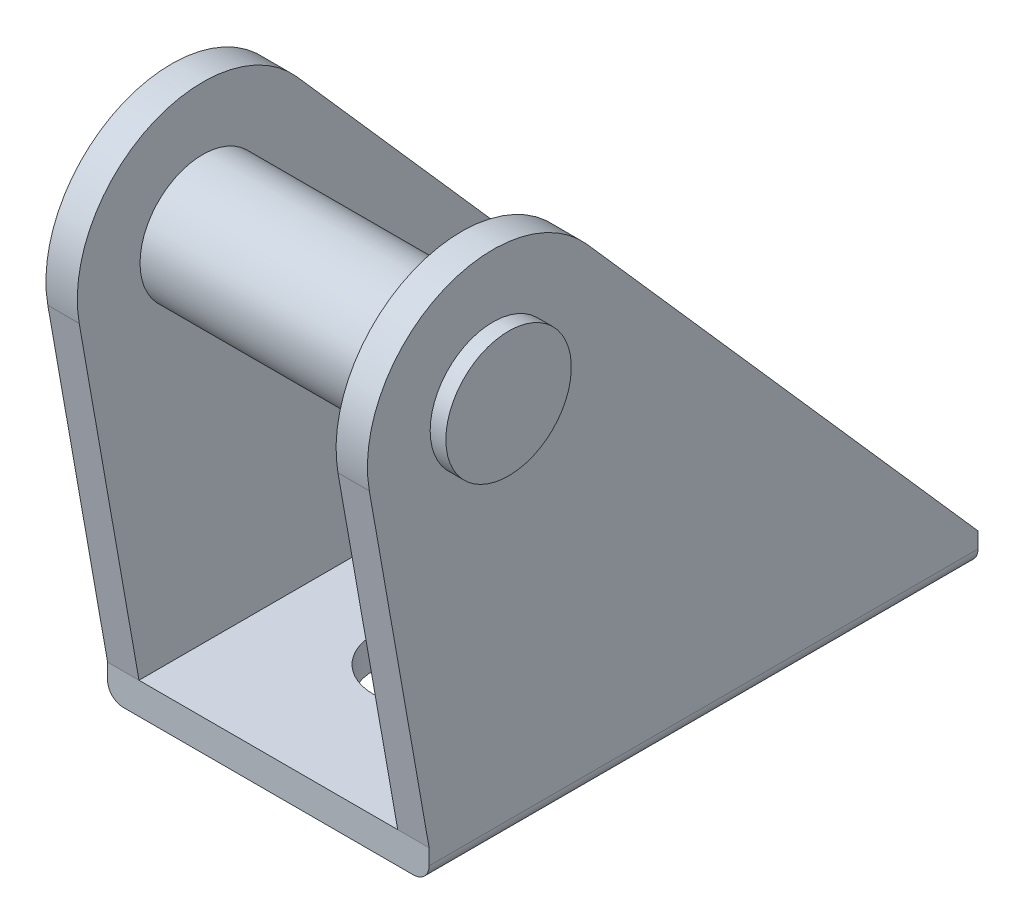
ISO-10303-21;
HEADER;
FILE_DESCRIPTION(('STEP AP214'),'2;1');
FILE_NAME('part.step','',(''),(''),'','','');
FILE_SCHEMA(('AUTOMOTIVE_DESIGN { 1 0 10303 214 1 1 1 1 }'));
ENDSEC;
DATA;
#1=APPLICATION_CONTEXT('core data for automotive mechanical design processes');
#2=APPLICATION_PROTOCOL_DEFINITION('international standard','automotive_design',2000,#1);
#3=PRODUCT_CONTEXT('',#1,'mechanical');
#4=PRODUCT('Part','Part','',(#3));
#5=PRODUCT_RELATED_PRODUCT_CATEGORY('part','',(#4));
#6=PRODUCT_DEFINITION_FORMATION('','',#4);
#7=PRODUCT_DEFINITION_CONTEXT('part definition',#1,'design');
#8=PRODUCT_DEFINITION('design','',#6,#7);
#9=PRODUCT_DEFINITION_SHAPE('','',#8);
#10=(LENGTH_UNIT() NAMED_UNIT(*) SI_UNIT(.MILLI.,.METRE.));
#11=(NAMED_UNIT(*) PLANE_ANGLE_UNIT() SI_UNIT($,.RADIAN.));
#12=(NAMED_UNIT(*) SI_UNIT($,.STERADIAN.) SOLID_ANGLE_UNIT());
#13=UNCERTAINTY_MEASURE_WITH_UNIT(LENGTH_MEASURE(1.E-05),#10,'distance_accuracy_value','');
#14=(GEOMETRIC_REPRESENTATION_CONTEXT(3) GLOBAL_UNCERTAINTY_ASSIGNED_CONTEXT((#13)) GLOBAL_UNIT_ASSIGNED_CONTEXT((#10,
#11,#12)) REPRESENTATION_CONTEXT('',''));
#15=CARTESIAN_POINT('',(0.,0.,0.));
#16=DIRECTION('',(0.,0.,1.));
#17=DIRECTION('',(1.,0.,0.));
#18=AXIS2_PLACEMENT_3D('',#15,#16,#17);
#19=CARTESIAN_POINT('',(11.25,4.048,-4.048));
#20=DIRECTION('',(-1.,0.,0.));
#21=DIRECTION('',(0.,-1.,0.));
#22=AXIS2_PLACEMENT_3D('',#19,#20,#21);
#23=PLANE('',#22);
#24=CARTESIAN_POINT('',(11.25,0.,0.));
#25=DIRECTION('',(-1.,0.,0.));
#26=DIRECTION('',(0.,0.,1.));
#27=AXIS2_PLACEMENT_3D('',#24,#25,#26);
#28=CIRCLE('',#27,4.);
#29=CARTESIAN_POINT('',(11.25,0.,4.));
#30=VERTEX_POINT('',#29);
#31=EDGE_CURVE('E19',#30,#30,#28,.F.);
#32=ORIENTED_EDGE('',*,*,#31,.T.);
#33=EDGE_LOOP('',(#32));
#34=FACE_BOUND('',#33,.T.);
#35=ADVANCED_FACE('F15',(#34),#23,.F.);
#36=CARTESIAN_POINT('',(-11.25,-4.048,4.048));
#37=DIRECTION('',(1.,0.,0.));
#38=DIRECTION('',(0.,0.,-1.));
#39=AXIS2_PLACEMENT_3D('',#36,#37,#38);
#40=PLANE('',#39);
#41=CARTESIAN_POINT('',(-11.25,0.,0.));
#42=DIRECTION('',(-1.,0.,0.));
#43=DIRECTION('',(0.,0.,1.));
#44=AXIS2_PLACEMENT_3D('',#41,#42,#43);
#45=CIRCLE('',#44,4.);
#46=CARTESIAN_POINT('',(-11.25,0.,4.));
#47=VERTEX_POINT('',#46);
#48=EDGE_CURVE('E172',#47,#47,#45,.T.);
#49=ORIENTED_EDGE('',*,*,#48,.T.);
#50=EDGE_LOOP('',(#49));
#51=FACE_BOUND('',#50,.T.);
#52=ADVANCED_FACE('F235',(#51),#40,.F.);
#53=CARTESIAN_POINT('',(11.25,0.,0.));
#54=DIRECTION('',(-1.,0.,0.));
#55=DIRECTION('',(0.,0.,1.));
#56=AXIS2_PLACEMENT_3D('',#53,#54,#55);
#57=CYLINDRICAL_SURFACE('',#56,4.);
#58=ORIENTED_EDGE('',*,*,#31,.F.);
#59=EDGE_LOOP('',(#58));
#60=FACE_BOUND('',#59,.T.);
#61=CARTESIAN_POINT('',(10.25,0.,0.));
#62=DIRECTION('',(-1.,0.,0.));
#63=DIRECTION('',(0.,0.,1.));
#64=AXIS2_PLACEMENT_3D('',#61,#62,#63);
#65=CIRCLE('',#64,4.);
#66=CARTESIAN_POINT('',(10.25,0.,4.));
#67=VERTEX_POINT('',#66);
#68=EDGE_CURVE('E162',#67,#67,#65,.F.);
#69=ORIENTED_EDGE('',*,*,#68,.T.);
#70=EDGE_LOOP('',(#69));
#71=FACE_BOUND('',#70,.T.);
#72=ADVANCED_FACE('F231',(#60,#71),#57,.T.);
#73=CARTESIAN_POINT('',(-10.25,0.,0.));
#74=DIRECTION('',(-1.,0.,0.));
#75=DIRECTION('',(0.,0.,1.));
#76=AXIS2_PLACEMENT_3D('',#73,#74,#75);
#77=CYLINDRICAL_SURFACE('',#76,4.);
#78=ORIENTED_EDGE('',*,*,#48,.F.);
#79=EDGE_LOOP('',(#78));
#80=FACE_BOUND('',#79,.T.);
#81=CARTESIAN_POINT('',(-10.25,0.,0.));
#82=DIRECTION('',(-1.,0.,0.));
#83=DIRECTION('',(0.,0.,1.));
#84=AXIS2_PLACEMENT_3D('',#81,#82,#83);
#85=CIRCLE('',#84,4.);
#86=CARTESIAN_POINT('',(-10.25,0.,4.));
#87=VERTEX_POINT('',#86);
#88=EDGE_CURVE('E148',#87,#87,#85,.T.);
#89=ORIENTED_EDGE('',*,*,#88,.T.);
#90=EDGE_LOOP('',(#89));
#91=FACE_BOUND('',#90,.T.);
#92=ADVANCED_FACE('F234',(#80,#91),#77,.T.);
#93=CARTESIAN_POINT('',(10.25,8.192,-30.932107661));
#94=DIRECTION('',(-1.,0.,0.));
#95=DIRECTION('',(0.,-1.,0.));
#96=AXIS2_PLACEMENT_3D('',#93,#94,#95);
#97=PLANE('',#96);
#98=ORIENTED_EDGE('',*,*,#68,.F.);
#99=EDGE_LOOP('',(#98));
#100=FACE_BOUND('',#99,.T.);
#101=DIRECTION('',(0.,0.,1.));
#102=VECTOR('',#101,1.);
#103=CARTESIAN_POINT('',(10.25,-24.0000000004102,-13.432107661));
#104=LINE('',#103,#102);
#105=CARTESIAN_POINT('',(10.25,-24.0000000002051,4.0678923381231));
#106=VERTEX_POINT('',#105);
#107=CARTESIAN_POINT('',(10.25,-24.0000000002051,-30.932107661));
#108=VERTEX_POINT('',#107);
#109=EDGE_CURVE('E127',#106,#108,#104,.F.);
#110=ORIENTED_EDGE('',*,*,#109,.T.);
#111=DIRECTION('',(0.,-1.,0.));
#112=VECTOR('',#111,1.);
#113=CARTESIAN_POINT('',(10.25,-7.904,-30.932107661));
#114=LINE('',#113,#112);
#115=CARTESIAN_POINT('',(10.25,-23.0000000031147,-30.932107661));
#116=VERTEX_POINT('',#115);
#117=EDGE_CURVE('E168',#116,#108,#114,.T.);
#118=ORIENTED_EDGE('',*,*,#117,.F.);
#119=DIRECTION('',(0.,0.750245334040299,0.661159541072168));
#120=VECTOR('',#119,1.);
#121=CARTESIAN_POINT('',(10.25,-8.8553618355,-18.4670351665));
#122=LINE('',#121,#120);
#123=CARTESIAN_POINT('',(10.25,5.289276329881,-6.00196267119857));
#124=VERTEX_POINT('',#123);
#125=EDGE_CURVE('E152',#116,#124,#122,.T.);
#126=ORIENTED_EDGE('',*,*,#125,.T.);
#127=CARTESIAN_POINT('',(10.25,0.,0.));
#128=DIRECTION('',(1.,0.,0.));
#129=DIRECTION('',(0.,0.,-1.));
#130=AXIS2_PLACEMENT_3D('',#127,#128,#129);
#131=CIRCLE('',#130,8.);
#132=CARTESIAN_POINT('',(10.25,-1.3891854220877,7.87846202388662));
#133=VERTEX_POINT('',#132);
#134=EDGE_CURVE('E216',#124,#133,#131,.T.);
#135=ORIENTED_EDGE('',*,*,#134,.T.);
#136=DIRECTION('',(0.,0.984807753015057,0.173648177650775));
#137=VECTOR('',#136,1.);
#138=CARTESIAN_POINT('',(10.25,-12.1945927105,5.9731771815));
#139=LINE('',#138,#137);
#140=CARTESIAN_POINT('',(10.25,-23.0000000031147,4.0678923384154));
#141=VERTEX_POINT('',#140);
#142=EDGE_CURVE('E118',#141,#133,#139,.T.);
#143=ORIENTED_EDGE('',*,*,#142,.F.);
#144=DIRECTION('',(0.,1.,0.));
#145=VECTOR('',#144,1.);
#146=CARTESIAN_POINT('',(10.25,-7.904,4.0678923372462));
#147=LINE('',#146,#145);
#148=EDGE_CURVE('E165',#106,#141,#147,.T.);
#149=ORIENTED_EDGE('',*,*,#148,.F.);
#150=EDGE_LOOP('',(#110,#118,#126,#135,#143,#149));
#151=FACE_BOUND('',#150,.T.);
#152=ADVANCED_FACE('F239',(#100,#151),#97,.F.);
#153=CARTESIAN_POINT('',(-10.25,-24.,8.233592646));
#154=DIRECTION('',(1.,0.,0.));
#155=DIRECTION('',(0.,0.,-1.));
#156=AXIS2_PLACEMENT_3D('',#153,#154,#155);
#157=PLANE('',#156);
#158=ORIENTED_EDGE('',*,*,#88,.F.);
#159=EDGE_LOOP('',(#158));
#160=FACE_BOUND('',#159,.T.);
#161=DIRECTION('',(0.,0.,-1.));
#162=VECTOR('',#161,1.);
#163=CARTESIAN_POINT('',(-10.25,-24.0000000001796,-13.432107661));
#164=LINE('',#163,#162);
#165=CARTESIAN_POINT('',(-10.25,-24.0000000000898,-30.932107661));
#166=VERTEX_POINT('',#165);
#167=CARTESIAN_POINT('',(-10.25,-24.0000000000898,4.0678923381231));
#168=VERTEX_POINT('',#167);
#169=EDGE_CURVE('E215',#166,#168,#164,.F.);
#170=ORIENTED_EDGE('',*,*,#169,.T.);
#171=DIRECTION('',(0.,-1.,0.));
#172=VECTOR('',#171,1.);
#173=CARTESIAN_POINT('',(-10.25,-7.904,4.06789233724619));
#174=LINE('',#173,#172);
#175=CARTESIAN_POINT('',(-10.25,-23.0000000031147,4.0678923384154));
#176=VERTEX_POINT('',#175);
#177=EDGE_CURVE('E158',#176,#168,#174,.T.);
#178=ORIENTED_EDGE('',*,*,#177,.F.);
#179=DIRECTION('',(0.,-0.984807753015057,-0.173648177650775));
#180=VECTOR('',#179,1.);
#181=CARTESIAN_POINT('',(-10.25,-12.1945927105,5.9731771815));
#182=LINE('',#181,#180);
#183=CARTESIAN_POINT('',(-10.25,-1.3891854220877,7.87846202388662));
#184=VERTEX_POINT('',#183);
#185=EDGE_CURVE('E98',#184,#176,#182,.T.);
#186=ORIENTED_EDGE('',*,*,#185,.F.);
#187=CARTESIAN_POINT('',(-10.25,0.,0.));
#188=DIRECTION('',(1.,0.,0.));
#189=DIRECTION('',(0.,0.,-1.));
#190=AXIS2_PLACEMENT_3D('',#187,#188,#189);
#191=CIRCLE('',#190,8.);
#192=CARTESIAN_POINT('',(-10.25,5.28927632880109,-6.00196267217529));
#193=VERTEX_POINT('',#192);
#194=EDGE_CURVE('E101',#184,#193,#191,.F.);
#195=ORIENTED_EDGE('',*,*,#194,.T.);
#196=DIRECTION('',(0.,-0.750245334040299,-0.661159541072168));
#197=VECTOR('',#196,1.);
#198=CARTESIAN_POINT('',(-10.25,-8.8553618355,-18.4670351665));
#199=LINE('',#198,#197);
#200=CARTESIAN_POINT('',(-10.25,-23.0000000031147,-30.932107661));
#201=VERTEX_POINT('',#200);
#202=EDGE_CURVE('E105',#193,#201,#199,.T.);
#203=ORIENTED_EDGE('',*,*,#202,.T.);
#204=DIRECTION('',(0.,1.,0.));
#205=VECTOR('',#204,1.);
#206=CARTESIAN_POINT('',(-10.25,-7.904,-30.932107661));
#207=LINE('',#206,#205);
#208=EDGE_CURVE('E155',#166,#201,#207,.T.);
#209=ORIENTED_EDGE('',*,*,#208,.F.);
#210=EDGE_LOOP('',(#170,#178,#186,#195,#203,#209));
#211=FACE_BOUND('',#210,.T.);
#212=ADVANCED_FACE('F104',(#160,#211),#157,.F.);
#213=CARTESIAN_POINT('',(-10.25,-1.389185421,7.878462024));
#214=DIRECTION('',(0.,-0.173648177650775,0.984807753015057));
#215=DIRECTION('',(0.,-0.984807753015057,-0.173648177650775));
#216=AXIS2_PLACEMENT_3D('',#213,#214,#215);
#217=PLANE('',#216);
#218=ORIENTED_EDGE('',*,*,#185,.T.);
#219=DIRECTION('',(-1.,0.,0.));
#220=VECTOR('',#219,1.);
#221=CARTESIAN_POINT('',(0.,-23.,4.067892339));
#222=LINE('',#221,#220);
#223=CARTESIAN_POINT('',(-8.24999999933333,-23.,4.067892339));
#224=VERTEX_POINT('',#223);
#225=EDGE_CURVE('E140',#224,#176,#222,.T.);
#226=ORIENTED_EDGE('',*,*,#225,.F.);
#227=DIRECTION('',(0.,-0.984807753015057,-0.173648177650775));
#228=VECTOR('',#227,1.);
#229=CARTESIAN_POINT('',(-8.25,-1.389185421,7.878462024));
#230=LINE('',#229,#228);
#231=CARTESIAN_POINT('',(-8.25,-1.3891854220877,7.87846202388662));
#232=VERTEX_POINT('',#231);
#233=EDGE_CURVE('E143',#224,#232,#230,.F.);
#234=ORIENTED_EDGE('',*,*,#233,.T.);
#235=DIRECTION('',(1.,0.,0.));
#236=VECTOR('',#235,1.);
#237=CARTESIAN_POINT('',(-9.25,-1.38918542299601,7.87846202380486));
#238=LINE('',#237,#236);
#239=EDGE_CURVE('E111',#232,#184,#238,.F.);
#240=ORIENTED_EDGE('',*,*,#239,.T.);
#241=EDGE_LOOP('',(#218,#226,#234,#240));
#242=FACE_BOUND('',#241,.T.);
#243=ADVANCED_FACE('F311',(#242),#217,.T.);
#244=CARTESIAN_POINT('',(-10.25,0.,0.));
#245=DIRECTION('',(1.,0.,0.));
#246=DIRECTION('',(0.,0.,-1.));
#247=AXIS2_PLACEMENT_3D('',#244,#245,#246);
#248=CYLINDRICAL_SURFACE('',#247,8.);
#249=DIRECTION('',(-1.,0.,0.));
#250=VECTOR('',#249,1.);
#251=CARTESIAN_POINT('',(-9.25,5.289276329,-6.001962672));
#252=LINE('',#251,#250);
#253=CARTESIAN_POINT('',(-8.25,5.28927632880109,-6.00196267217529));
#254=VERTEX_POINT('',#253);
#255=EDGE_CURVE('E110',#254,#193,#252,.T.);
#256=ORIENTED_EDGE('',*,*,#255,.T.);
#257=ORIENTED_EDGE('',*,*,#194,.F.);
#258=ORIENTED_EDGE('',*,*,#239,.F.);
#259=CARTESIAN_POINT('',(-8.25,0.,0.));
#260=DIRECTION('',(1.,0.,0.));
#261=DIRECTION('',(0.,0.,-1.));
#262=AXIS2_PLACEMENT_3D('',#259,#260,#261);
#263=CIRCLE('',#262,8.);
#264=EDGE_CURVE('E123',#232,#254,#263,.F.);
#265=ORIENTED_EDGE('',*,*,#264,.T.);
#266=EDGE_LOOP('',(#256,#257,#258,#265));
#267=FACE_BOUND('',#266,.T.);
#268=ADVANCED_FACE('F121',(#267),#248,.T.);
#269=CARTESIAN_POINT('',(-10.25,5.289276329,-6.001962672));
#270=DIRECTION('',(0.,-0.661159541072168,0.750245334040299));
#271=DIRECTION('',(0.,-0.750245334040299,-0.661159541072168));
#272=AXIS2_PLACEMENT_3D('',#269,#270,#271);
#273=PLANE('',#272);
#274=ORIENTED_EDGE('',*,*,#202,.F.);
#275=ORIENTED_EDGE('',*,*,#255,.F.);
#276=DIRECTION('',(0.,-0.750245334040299,-0.661159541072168));
#277=VECTOR('',#276,1.);
#278=CARTESIAN_POINT('',(-8.25,5.289276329,-6.001962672));
#279=LINE('',#278,#277);
#280=CARTESIAN_POINT('',(-8.2499999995,-23.,-30.932107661));
#281=VERTEX_POINT('',#280);
#282=EDGE_CURVE('E205',#254,#281,#279,.T.);
#283=ORIENTED_EDGE('',*,*,#282,.T.);
#284=DIRECTION('',(-1.,0.,0.));
#285=VECTOR('',#284,1.);
#286=CARTESIAN_POINT('',(0.,-23.,-30.932107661));
#287=LINE('',#286,#285);
#288=EDGE_CURVE('E117',#281,#201,#287,.T.);
#289=ORIENTED_EDGE('',*,*,#288,.T.);
#290=EDGE_LOOP('',(#274,#275,#283,#289));
#291=FACE_BOUND('',#290,.T.);
#292=ADVANCED_FACE('F114',(#291),#273,.F.);
#293=CARTESIAN_POINT('',(8.25,-1.389185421,7.878462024));
#294=DIRECTION('',(0.,-0.173648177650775,0.984807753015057));
#295=DIRECTION('',(0.,-0.984807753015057,-0.173648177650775));
#296=AXIS2_PLACEMENT_3D('',#293,#294,#295);
#297=PLANE('',#296);
#298=ORIENTED_EDGE('',*,*,#142,.T.);
#299=DIRECTION('',(1.,0.,0.));
#300=VECTOR('',#299,1.);
#301=CARTESIAN_POINT('',(9.25,-1.38918542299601,7.87846202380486));
#302=LINE('',#301,#300);
#303=CARTESIAN_POINT('',(8.25,-1.3891854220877,7.87846202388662));
#304=VERTEX_POINT('',#303);
#305=EDGE_CURVE('E218',#133,#304,#302,.F.);
#306=ORIENTED_EDGE('',*,*,#305,.T.);
#307=DIRECTION('',(0.,-0.984807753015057,-0.173648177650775));
#308=VECTOR('',#307,1.);
#309=CARTESIAN_POINT('',(8.25,-1.389185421,7.878462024));
#310=LINE('',#309,#308);
#311=CARTESIAN_POINT('',(8.25,-23.,4.067892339));
#312=VERTEX_POINT('',#311);
#313=EDGE_CURVE('E195',#304,#312,#310,.T.);
#314=ORIENTED_EDGE('',*,*,#313,.T.);
#315=DIRECTION('',(-1.,0.,0.));
#316=VECTOR('',#315,1.);
#317=CARTESIAN_POINT('',(0.,-23.,4.067892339));
#318=LINE('',#317,#316);
#319=EDGE_CURVE('E144',#141,#312,#318,.T.);
#320=ORIENTED_EDGE('',*,*,#319,.F.);
#321=EDGE_LOOP('',(#298,#306,#314,#320));
#322=FACE_BOUND('',#321,.T.);
#323=ADVANCED_FACE('F305',(#322),#297,.T.);
#324=CARTESIAN_POINT('',(8.25,5.289276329,-6.001962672));
#325=DIRECTION('',(0.,-0.661159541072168,0.750245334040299));
#326=DIRECTION('',(0.,-0.750245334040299,-0.661159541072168));
#327=AXIS2_PLACEMENT_3D('',#324,#325,#326);
#328=PLANE('',#327);
#329=ORIENTED_EDGE('',*,*,#125,.F.);
#330=DIRECTION('',(-1.,0.,0.));
#331=VECTOR('',#330,1.);
#332=CARTESIAN_POINT('',(0.,-23.,-30.932107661));
#333=LINE('',#332,#331);
#334=CARTESIAN_POINT('',(8.25,-23.,-30.932107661));
#335=VERTEX_POINT('',#334);
#336=EDGE_CURVE('E131',#116,#335,#333,.T.);
#337=ORIENTED_EDGE('',*,*,#336,.T.);
#338=DIRECTION('',(0.,-0.750245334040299,-0.661159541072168));
#339=VECTOR('',#338,1.);
#340=CARTESIAN_POINT('',(8.25,5.289276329,-6.001962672));
#341=LINE('',#340,#339);
#342=CARTESIAN_POINT('',(8.25,5.289276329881,-6.00196267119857));
#343=VERTEX_POINT('',#342);
#344=EDGE_CURVE('E34',#335,#343,#341,.F.);
#345=ORIENTED_EDGE('',*,*,#344,.T.);
#346=DIRECTION('',(-1.,0.,0.));
#347=VECTOR('',#346,1.);
#348=CARTESIAN_POINT('',(9.25,5.28927633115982,-6.00196267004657));
#349=LINE('',#348,#347);
#350=EDGE_CURVE('E219',#343,#124,#349,.F.);
#351=ORIENTED_EDGE('',*,*,#350,.T.);
#352=EDGE_LOOP('',(#329,#337,#345,#351));
#353=FACE_BOUND('',#352,.T.);
#354=ADVANCED_FACE('F292',(#353),#328,.F.);
#355=CARTESIAN_POINT('',(8.25,0.,0.));
#356=DIRECTION('',(1.,0.,0.));
#357=DIRECTION('',(0.,0.,-1.));
#358=AXIS2_PLACEMENT_3D('',#355,#356,#357);
#359=CYLINDRICAL_SURFACE('',#358,8.);
#360=ORIENTED_EDGE('',*,*,#305,.F.);
#361=ORIENTED_EDGE('',*,*,#134,.F.);
#362=ORIENTED_EDGE('',*,*,#350,.F.);
#363=CARTESIAN_POINT('',(8.25,0.,0.));
#364=DIRECTION('',(1.,0.,0.));
#365=DIRECTION('',(0.,0.,-1.));
#366=AXIS2_PLACEMENT_3D('',#363,#364,#365);
#367=CIRCLE('',#366,8.);
#368=EDGE_CURVE('E191',#343,#304,#367,.T.);
#369=ORIENTED_EDGE('',*,*,#368,.T.);
#370=EDGE_LOOP('',(#360,#361,#362,#369));
#371=FACE_BOUND('',#370,.T.);
#372=ADVANCED_FACE('F291',(#371),#359,.T.);
#373=CARTESIAN_POINT('',(8.25,0.,0.));
#374=DIRECTION('',(-1.,0.,0.));
#375=DIRECTION('',(0.,0.,1.));
#376=AXIS2_PLACEMENT_3D('',#373,#374,#375);
#377=CYLINDRICAL_SURFACE('',#376,4.);
#378=CARTESIAN_POINT('',(-8.25,0.,0.));
#379=DIRECTION('',(-1.,0.,0.));
#380=DIRECTION('',(0.,0.,1.));
#381=AXIS2_PLACEMENT_3D('',#378,#379,#380);
#382=CIRCLE('',#381,4.);
#383=CARTESIAN_POINT('',(-8.25,0.,4.));
#384=VERTEX_POINT('',#383);
#385=EDGE_CURVE('E202',#384,#384,#382,.F.);
#386=ORIENTED_EDGE('',*,*,#385,.T.);
#387=EDGE_LOOP('',(#386));
#388=FACE_BOUND('',#387,.T.);
#389=CARTESIAN_POINT('',(8.25,0.,0.));
#390=DIRECTION('',(-1.,0.,0.));
#391=DIRECTION('',(0.,0.,1.));
#392=AXIS2_PLACEMENT_3D('',#389,#390,#391);
#393=CIRCLE('',#392,4.);
#394=CARTESIAN_POINT('',(8.25,0.,4.));
#395=VERTEX_POINT('',#394);
#396=EDGE_CURVE('E187',#395,#395,#393,.T.);
#397=ORIENTED_EDGE('',*,*,#396,.T.);
#398=EDGE_LOOP('',(#397));
#399=FACE_BOUND('',#398,.T.);
#400=ADVANCED_FACE('F409',(#388,#399),#377,.T.);
#401=CARTESIAN_POINT('',(9.25,-24.,4.067892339));
#402=DIRECTION('',(0.,0.,-1.));
#403=DIRECTION('',(-1.,0.,0.));
#404=AXIS2_PLACEMENT_3D('',#401,#402,#403);
#405=CYLINDRICAL_SURFACE('',#404,0.999999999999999);
#406=DIRECTION('',(0.,0.,-1.));
#407=VECTOR('',#406,1.);
#408=CARTESIAN_POINT('',(9.25,-25.,-13.432107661));
#409=LINE('',#408,#407);
#410=CARTESIAN_POINT('',(9.25,-25.,4.067892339));
#411=VERTEX_POINT('',#410);
#412=CARTESIAN_POINT('',(9.25,-25.,-30.932107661));
#413=VERTEX_POINT('',#412);
#414=EDGE_CURVE('E190',#411,#413,#409,.T.);
#415=ORIENTED_EDGE('',*,*,#414,.T.);
#416=CARTESIAN_POINT('',(9.25,-24.,-30.932107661));
#417=DIRECTION('',(0.,0.,-1.));
#418=DIRECTION('',(-1.,0.,0.));
#419=AXIS2_PLACEMENT_3D('',#416,#417,#418);
#420=CIRCLE('',#419,0.999999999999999);
#421=EDGE_CURVE('E199',#413,#108,#420,.F.);
#422=ORIENTED_EDGE('',*,*,#421,.T.);
#423=ORIENTED_EDGE('',*,*,#109,.F.);
#424=CARTESIAN_POINT('',(9.25,-24.,4.067892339));
#425=DIRECTION('',(0.,0.,-1.));
#426=DIRECTION('',(-1.,0.,0.));
#427=AXIS2_PLACEMENT_3D('',#424,#425,#426);
#428=CIRCLE('',#427,0.999999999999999);
#429=EDGE_CURVE('E210',#411,#106,#428,.F.);
#430=ORIENTED_EDGE('',*,*,#429,.F.);
#431=EDGE_LOOP('',(#415,#422,#423,#430));
#432=FACE_BOUND('',#431,.T.);
#433=ADVANCED_FACE('F251',(#432),#405,.T.);
#434=CARTESIAN_POINT('',(-9.25,-24.,4.067892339));
#435=DIRECTION('',(0.,0.,-1.));
#436=DIRECTION('',(-1.,0.,0.));
#437=AXIS2_PLACEMENT_3D('',#434,#435,#436);
#438=CYLINDRICAL_SURFACE('',#437,1.);
#439=ORIENTED_EDGE('',*,*,#169,.F.);
#440=CARTESIAN_POINT('',(-9.25,-24.,-30.932107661));
#441=DIRECTION('',(0.,0.,-1.));
#442=DIRECTION('',(-1.,0.,0.));
#443=AXIS2_PLACEMENT_3D('',#440,#441,#442);
#444=CIRCLE('',#443,1.);
#445=CARTESIAN_POINT('',(-9.25,-25.,-30.932107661));
#446=VERTEX_POINT('',#445);
#447=EDGE_CURVE('E130',#166,#446,#444,.F.);
#448=ORIENTED_EDGE('',*,*,#447,.T.);
#449=DIRECTION('',(0.,0.,1.));
#450=VECTOR('',#449,1.);
#451=CARTESIAN_POINT('',(-9.25,-25.,-13.432107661));
#452=LINE('',#451,#450);
#453=CARTESIAN_POINT('',(-9.25,-25.,4.067892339));
#454=VERTEX_POINT('',#453);
#455=EDGE_CURVE('E264',#446,#454,#452,.T.);
#456=ORIENTED_EDGE('',*,*,#455,.T.);
#457=CARTESIAN_POINT('',(-9.25,-24.,4.067892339));
#458=DIRECTION('',(0.,0.,-1.));
#459=DIRECTION('',(-1.,0.,0.));
#460=AXIS2_PLACEMENT_3D('',#457,#458,#459);
#461=CIRCLE('',#460,1.);
#462=EDGE_CURVE('E213',#168,#454,#461,.F.);
#463=ORIENTED_EDGE('',*,*,#462,.F.);
#464=EDGE_LOOP('',(#439,#448,#456,#463));
#465=FACE_BOUND('',#464,.T.);
#466=ADVANCED_FACE('F427',(#465),#438,.T.);
#467=CARTESIAN_POINT('',(-10.25,-25.,4.067892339));
#468=DIRECTION('',(0.,0.,1.));
#469=DIRECTION('',(1.,0.,0.));
#470=AXIS2_PLACEMENT_3D('',#467,#468,#469);
#471=PLANE('',#470);
#472=DIRECTION('',(-1.,0.,0.));
#473=VECTOR('',#472,1.);
#474=CARTESIAN_POINT('',(0.,-23.,4.067892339));
#475=LINE('',#474,#473);
#476=EDGE_CURVE('E138',#312,#224,#475,.T.);
#477=ORIENTED_EDGE('',*,*,#476,.T.);
#478=ORIENTED_EDGE('',*,*,#225,.T.);
#479=ORIENTED_EDGE('',*,*,#177,.T.);
#480=ORIENTED_EDGE('',*,*,#462,.T.);
#481=DIRECTION('',(1.,0.,0.));
#482=VECTOR('',#481,1.);
#483=CARTESIAN_POINT('',(0.,-25.,4.067892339));
#484=LINE('',#483,#482);
#485=EDGE_CURVE('E186',#454,#411,#484,.T.);
#486=ORIENTED_EDGE('',*,*,#485,.T.);
#487=ORIENTED_EDGE('',*,*,#429,.T.);
#488=ORIENTED_EDGE('',*,*,#148,.T.);
#489=ORIENTED_EDGE('',*,*,#319,.T.);
#490=EDGE_LOOP('',(#477,#478,#479,#480,#486,#487,#488,#489));
#491=FACE_BOUND('',#490,.T.);
#492=ADVANCED_FACE('F302',(#491),#471,.T.);
#493=CARTESIAN_POINT('',(-8.25,8.186,-31.165700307));
#494=DIRECTION('',(-1.,0.,0.));
#495=DIRECTION('',(0.,-1.,0.));
#496=AXIS2_PLACEMENT_3D('',#493,#494,#495);
#497=PLANE('',#496);
#498=ORIENTED_EDGE('',*,*,#385,.F.);
#499=EDGE_LOOP('',(#498));
#500=FACE_BOUND('',#499,.T.);
#501=ORIENTED_EDGE('',*,*,#264,.F.);
#502=ORIENTED_EDGE('',*,*,#233,.F.);
#503=DIRECTION('',(0.,0.,-1.));
#504=VECTOR('',#503,1.);
#505=CARTESIAN_POINT('',(-8.25,-23.,-13.432107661));
#506=LINE('',#505,#504);
#507=EDGE_CURVE('E134',#224,#281,#506,.T.);
#508=ORIENTED_EDGE('',*,*,#507,.T.);
#509=ORIENTED_EDGE('',*,*,#282,.F.);
#510=EDGE_LOOP('',(#501,#502,#508,#509));
#511=FACE_BOUND('',#510,.T.);
#512=ADVANCED_FACE('F299',(#500,#511),#497,.F.);
#513=CARTESIAN_POINT('',(-10.25,-25.,-30.932107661));
#514=DIRECTION('',(0.,0.,1.));
#515=DIRECTION('',(1.,0.,0.));
#516=AXIS2_PLACEMENT_3D('',#513,#514,#515);
#517=PLANE('',#516);
#518=ORIENTED_EDGE('',*,*,#447,.F.);
#519=ORIENTED_EDGE('',*,*,#208,.T.);
#520=ORIENTED_EDGE('',*,*,#288,.F.);
#521=DIRECTION('',(1.,0.,0.));
#522=VECTOR('',#521,1.);
#523=CARTESIAN_POINT('',(0.,-23.,-30.932107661));
#524=LINE('',#523,#522);
#525=EDGE_CURVE('E137',#281,#335,#524,.T.);
#526=ORIENTED_EDGE('',*,*,#525,.T.);
#527=ORIENTED_EDGE('',*,*,#336,.F.);
#528=ORIENTED_EDGE('',*,*,#117,.T.);
#529=ORIENTED_EDGE('',*,*,#421,.F.);
#530=DIRECTION('',(-1.,0.,0.));
#531=VECTOR('',#530,1.);
#532=CARTESIAN_POINT('',(0.,-25.,-30.932107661));
#533=LINE('',#532,#531);
#534=EDGE_CURVE('E257',#413,#446,#533,.T.);
#535=ORIENTED_EDGE('',*,*,#534,.T.);
#536=EDGE_LOOP('',(#518,#519,#520,#526,#527,#528,#529,#535));
#537=FACE_BOUND('',#536,.T.);
#538=ADVANCED_FACE('F256',(#537),#517,.F.);
#539=CARTESIAN_POINT('',(8.25,-23.,-31.165700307));
#540=DIRECTION('',(1.,0.,0.));
#541=DIRECTION('',(0.,1.,0.));
#542=AXIS2_PLACEMENT_3D('',#539,#540,#541);
#543=PLANE('',#542);
#544=ORIENTED_EDGE('',*,*,#396,.F.);
#545=EDGE_LOOP('',(#544));
#546=FACE_BOUND('',#545,.T.);
#547=ORIENTED_EDGE('',*,*,#344,.F.);
#548=DIRECTION('',(0.,0.,1.));
#549=VECTOR('',#548,1.);
#550=CARTESIAN_POINT('',(8.25,-23.,-13.432107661));
#551=LINE('',#550,#549);
#552=EDGE_CURVE('E182',#335,#312,#551,.T.);
#553=ORIENTED_EDGE('',*,*,#552,.T.);
#554=ORIENTED_EDGE('',*,*,#313,.F.);
#555=ORIENTED_EDGE('',*,*,#368,.F.);
#556=EDGE_LOOP('',(#547,#553,#554,#555));
#557=FACE_BOUND('',#556,.T.);
#558=ADVANCED_FACE('F461',(#546,#557),#543,.F.);
#559=CARTESIAN_POINT('',(0.,-25.,-20.932107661));
#560=DIRECTION('',(0.,1.,0.));
#561=DIRECTION('',(0.,0.,1.));
#562=AXIS2_PLACEMENT_3D('',#559,#560,#561);
#563=CYLINDRICAL_SURFACE('',#562,3.3);
#564=CARTESIAN_POINT('',(0.,-25.,-20.932107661));
#565=DIRECTION('',(0.,1.,0.));
#566=DIRECTION('',(0.,0.,1.));
#567=AXIS2_PLACEMENT_3D('',#564,#565,#566);
#568=CIRCLE('',#567,3.3);
#569=CARTESIAN_POINT('',(0.,-25.,-17.632107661));
#570=VERTEX_POINT('',#569);
#571=EDGE_CURVE('E183',#570,#570,#568,.F.);
#572=ORIENTED_EDGE('',*,*,#571,.T.);
#573=EDGE_LOOP('',(#572));
#574=FACE_BOUND('',#573,.T.);
#575=CARTESIAN_POINT('',(0.,-23.,-20.932107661));
#576=DIRECTION('',(0.,1.,0.));
#577=DIRECTION('',(0.,0.,1.));
#578=AXIS2_PLACEMENT_3D('',#575,#576,#577);
#579=CIRCLE('',#578,3.3);
#580=CARTESIAN_POINT('',(0.,-23.,-17.632107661));
#581=VERTEX_POINT('',#580);
#582=EDGE_CURVE('E179',#581,#581,#579,.T.);
#583=ORIENTED_EDGE('',*,*,#582,.T.);
#584=EDGE_LOOP('',(#583));
#585=FACE_BOUND('',#584,.T.);
#586=ADVANCED_FACE('F334',(#574,#585),#563,.F.);
#587=CARTESIAN_POINT('',(9.25,-25.,-30.932107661));
#588=DIRECTION('',(0.,1.,0.));
#589=DIRECTION('',(-1.,0.,0.));
#590=AXIS2_PLACEMENT_3D('',#587,#588,#589);
#591=PLANE('',#590);
#592=ORIENTED_EDGE('',*,*,#571,.F.);
#593=EDGE_LOOP('',(#592));
#594=FACE_BOUND('',#593,.T.);
#595=CARTESIAN_POINT('',(0.,-25.,-5.932107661));
#596=DIRECTION('',(0.,1.,0.));
#597=DIRECTION('',(0.,0.,1.));
#598=AXIS2_PLACEMENT_3D('',#595,#596,#597);
#599=CIRCLE('',#598,3.3);
#600=CARTESIAN_POINT('',(0.,-25.,-2.632107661));
#601=VERTEX_POINT('',#600);
#602=EDGE_CURVE('E25',#601,#601,#599,.F.);
#603=ORIENTED_EDGE('',*,*,#602,.F.);
#604=EDGE_LOOP('',(#603));
#605=FACE_BOUND('',#604,.T.);
#606=ORIENTED_EDGE('',*,*,#455,.F.);
#607=ORIENTED_EDGE('',*,*,#534,.F.);
#608=ORIENTED_EDGE('',*,*,#414,.F.);
#609=ORIENTED_EDGE('',*,*,#485,.F.);
#610=EDGE_LOOP('',(#606,#607,#608,#609));
#611=FACE_BOUND('',#610,.T.);
#612=ADVANCED_FACE('F261',(#594,#605,#611),#591,.F.);
#613=CARTESIAN_POINT('',(-8.25,-23.,-30.932107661));
#614=DIRECTION('',(0.,-1.,0.));
#615=DIRECTION('',(1.,0.,0.));
#616=AXIS2_PLACEMENT_3D('',#613,#614,#615);
#617=PLANE('',#616);
#618=ORIENTED_EDGE('',*,*,#582,.F.);
#619=EDGE_LOOP('',(#618));
#620=FACE_BOUND('',#619,.T.);
#621=CARTESIAN_POINT('',(0.,-23.,-5.932107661));
#622=DIRECTION('',(0.,1.,0.));
#623=DIRECTION('',(0.,0.,1.));
#624=AXIS2_PLACEMENT_3D('',#621,#622,#623);
#625=CIRCLE('',#624,3.3);
#626=CARTESIAN_POINT('',(0.,-23.,-2.632107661));
#627=VERTEX_POINT('',#626);
#628=EDGE_CURVE('E10',#627,#627,#625,.T.);
#629=ORIENTED_EDGE('',*,*,#628,.F.);
#630=EDGE_LOOP('',(#629));
#631=FACE_BOUND('',#630,.T.);
#632=ORIENTED_EDGE('',*,*,#525,.F.);
#633=ORIENTED_EDGE('',*,*,#507,.F.);
#634=ORIENTED_EDGE('',*,*,#476,.F.);
#635=ORIENTED_EDGE('',*,*,#552,.F.);
#636=EDGE_LOOP('',(#632,#633,#634,#635));
#637=FACE_BOUND('',#636,.T.);
#638=ADVANCED_FACE('F17',(#620,#631,#637),#617,.F.);
#639=CARTESIAN_POINT('',(0.,-25.,-5.932107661));
#640=DIRECTION('',(0.,1.,0.));
#641=DIRECTION('',(0.,0.,1.));
#642=AXIS2_PLACEMENT_3D('',#639,#640,#641);
#643=CYLINDRICAL_SURFACE('',#642,3.3);
#644=ORIENTED_EDGE('',*,*,#628,.T.);
#645=EDGE_LOOP('',(#644));
#646=FACE_BOUND('',#645,.T.);
#647=ORIENTED_EDGE('',*,*,#602,.T.);
#648=EDGE_LOOP('',(#647));
#649=FACE_BOUND('',#648,.T.);
#650=ADVANCED_FACE('F323',(#646,#649),#643,.F.);
#651=CLOSED_SHELL('',(#35,#52,#72,#92,#152,#212,#243,#268,#292,#323,#354,#372,#400,#433,#466,
#492,#512,#538,#558,#586,#612,#638,#650));
#652=MANIFOLD_SOLID_BREP('B1',#651);
#653=ADVANCED_BREP_SHAPE_REPRESENTATION('',(#18,#652),#14);
#654=SHAPE_DEFINITION_REPRESENTATION(#9,#653);
ENDSEC;
END-ISO-10303-21;
